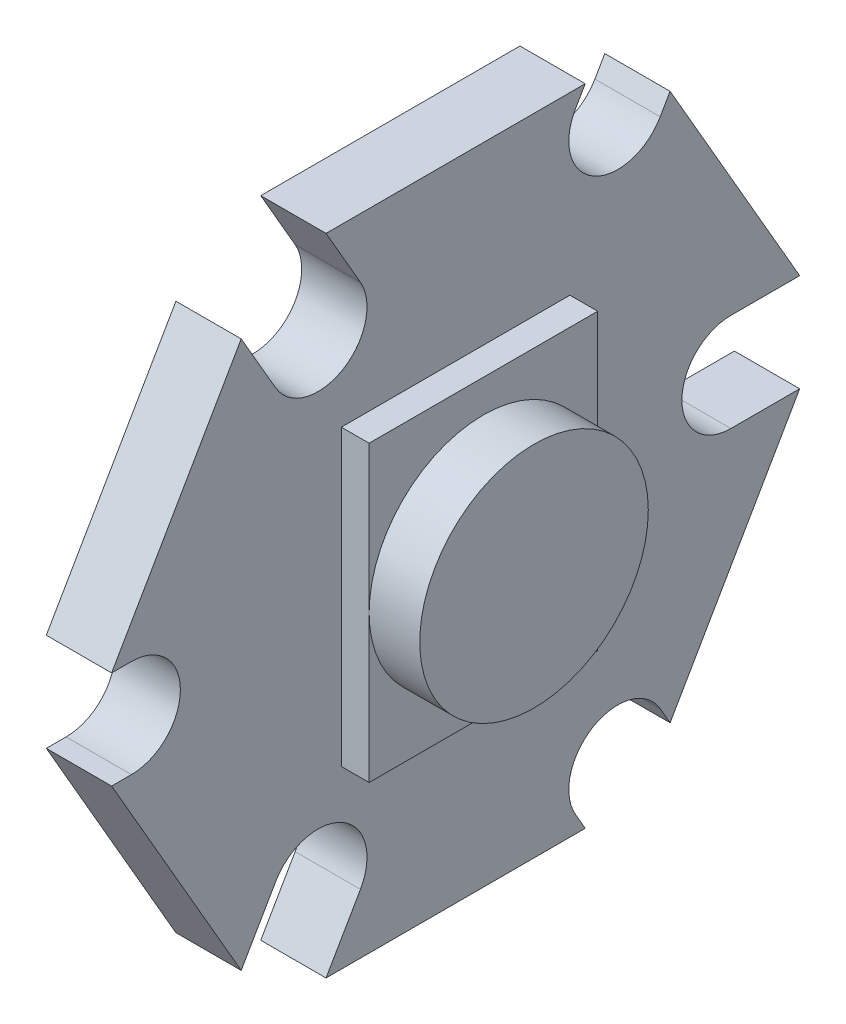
ISO-10303-21;
HEADER;
FILE_DESCRIPTION(('STEP AP214'),'2;1');
FILE_NAME('part.step','',(''),(''),'','','');
FILE_SCHEMA(('AUTOMOTIVE_DESIGN { 1 0 10303 214 1 1 1 1 }'));
ENDSEC;
DATA;
#1=APPLICATION_CONTEXT('core data for automotive mechanical design processes');
#2=APPLICATION_PROTOCOL_DEFINITION('international standard','automotive_design',2000,#1);
#3=PRODUCT_CONTEXT('',#1,'mechanical');
#4=PRODUCT('Part','Part','',(#3));
#5=PRODUCT_RELATED_PRODUCT_CATEGORY('part','',(#4));
#6=PRODUCT_DEFINITION_FORMATION('','',#4);
#7=PRODUCT_DEFINITION_CONTEXT('part definition',#1,'design');
#8=PRODUCT_DEFINITION('design','',#6,#7);
#9=PRODUCT_DEFINITION_SHAPE('','',#8);
#10=(LENGTH_UNIT() NAMED_UNIT(*) SI_UNIT(.MILLI.,.METRE.));
#11=(NAMED_UNIT(*) PLANE_ANGLE_UNIT() SI_UNIT($,.RADIAN.));
#12=(NAMED_UNIT(*) SI_UNIT($,.STERADIAN.) SOLID_ANGLE_UNIT());
#13=UNCERTAINTY_MEASURE_WITH_UNIT(LENGTH_MEASURE(1.E-05),#10,'distance_accuracy_value','');
#14=(GEOMETRIC_REPRESENTATION_CONTEXT(3) GLOBAL_UNCERTAINTY_ASSIGNED_CONTEXT((#13)) GLOBAL_UNIT_ASSIGNED_CONTEXT((#10,
#11,#12)) REPRESENTATION_CONTEXT('',''));
#15=CARTESIAN_POINT('',(0.,0.,0.));
#16=DIRECTION('',(0.,0.,1.));
#17=DIRECTION('',(1.,0.,0.));
#18=AXIS2_PLACEMENT_3D('',#15,#16,#17);
#19=CARTESIAN_POINT('',(1.85,0.,0.));
#20=DIRECTION('',(-1.,0.,0.));
#21=DIRECTION('',(0.,0.,1.));
#22=AXIS2_PLACEMENT_3D('',#19,#20,#21);
#23=PLANE('',#22);
#24=CARTESIAN_POINT('',(1.85,0.,0.));
#25=DIRECTION('',(1.,0.,0.));
#26=DIRECTION('',(0.,0.,-1.));
#27=AXIS2_PLACEMENT_3D('',#24,#25,#26);
#28=CIRCLE('',#27,3.5);
#29=CARTESIAN_POINT('',(1.85,0.,-3.5));
#30=VERTEX_POINT('',#29);
#31=CARTESIAN_POINT('',(1.85,0.,3.5));
#32=VERTEX_POINT('',#31);
#33=EDGE_CURVE('E61',#30,#32,#28,.T.);
#34=ORIENTED_EDGE('',*,*,#33,.F.);
#35=DIRECTION('',(0.,1.,0.));
#36=VECTOR('',#35,1.);
#37=CARTESIAN_POINT('',(1.85,-4.5,-3.5));
#38=LINE('',#37,#36);
#39=CARTESIAN_POINT('',(1.85,4.5,-3.5));
#40=VERTEX_POINT('',#39);
#41=EDGE_CURVE('E312',#30,#40,#38,.T.);
#42=ORIENTED_EDGE('',*,*,#41,.T.);
#43=DIRECTION('',(0.,0.,1.));
#44=VECTOR('',#43,1.);
#45=CARTESIAN_POINT('',(1.85,4.5,3.5));
#46=LINE('',#45,#44);
#47=CARTESIAN_POINT('',(1.85,4.5,3.5));
#48=VERTEX_POINT('',#47);
#49=EDGE_CURVE('E311',#40,#48,#46,.T.);
#50=ORIENTED_EDGE('',*,*,#49,.T.);
#51=DIRECTION('',(0.,-1.,0.));
#52=VECTOR('',#51,1.);
#53=CARTESIAN_POINT('',(1.85,-4.5,3.5));
#54=LINE('',#53,#52);
#55=EDGE_CURVE('E326',#48,#32,#54,.T.);
#56=ORIENTED_EDGE('',*,*,#55,.T.);
#57=EDGE_LOOP('',(#34,#42,#50,#56));
#58=FACE_BOUND('',#57,.T.);
#59=ADVANCED_FACE('F50',(#58),#23,.F.);
#60=EDGE_CURVE('E13',#32,#30,#28,.T.);
#61=ORIENTED_EDGE('',*,*,#60,.F.);
#62=CARTESIAN_POINT('',(1.85,-4.5,3.5));
#63=VERTEX_POINT('',#62);
#64=EDGE_CURVE('E788',#32,#63,#54,.T.);
#65=ORIENTED_EDGE('',*,*,#64,.T.);
#66=DIRECTION('',(0.,0.,-1.));
#67=VECTOR('',#66,1.);
#68=CARTESIAN_POINT('',(1.85,-4.5,3.5));
#69=LINE('',#68,#67);
#70=CARTESIAN_POINT('',(1.85,-4.5,-3.5));
#71=VERTEX_POINT('',#70);
#72=EDGE_CURVE('E306',#63,#71,#69,.T.);
#73=ORIENTED_EDGE('',*,*,#72,.T.);
#74=EDGE_CURVE('E303',#71,#30,#38,.T.);
#75=ORIENTED_EDGE('',*,*,#74,.T.);
#76=EDGE_LOOP('',(#61,#65,#73,#75));
#77=FACE_BOUND('',#76,.T.);
#78=ADVANCED_FACE('F305',(#77),#23,.F.);
#79=CARTESIAN_POINT('',(1.,0.,0.));
#80=DIRECTION('',(1.,0.,0.));
#81=DIRECTION('',(0.,0.,-1.));
#82=AXIS2_PLACEMENT_3D('',#79,#80,#81);
#83=PLANE('',#82);
#84=DIRECTION('',(0.,0.866025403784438,0.500000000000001));
#85=VECTOR('',#84,1.);
#86=CARTESIAN_POINT('',(1.,-7.84999999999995,-6.26425042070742));
#87=LINE('',#86,#85);
#88=CARTESIAN_POINT('',(1.,-8.375,-6.567359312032));
#89=VERTEX_POINT('',#88);
#90=CARTESIAN_POINT('',(1.,-7.84999999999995,-6.26425042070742));
#91=VERTEX_POINT('',#90);
#92=EDGE_CURVE('E734',#89,#91,#87,.T.);
#93=ORIENTED_EDGE('',*,*,#92,.F.);
#94=DIRECTION('',(0.,0.866025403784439,-0.499999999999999));
#95=VECTOR('',#94,1.);
#96=CARTESIAN_POINT('',(1.,-9.875,-5.70133390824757));
#97=LINE('',#96,#95);
#98=CARTESIAN_POINT('',(1.,-1.5,-10.5366424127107));
#99=VERTEX_POINT('',#98);
#100=EDGE_CURVE('E493',#89,#99,#97,.T.);
#101=ORIENTED_EDGE('',*,*,#100,.T.);
#102=DIRECTION('',(0.,0.,-1.));
#103=VECTOR('',#102,1.);
#104=CARTESIAN_POINT('',(1.,-1.5,-8.4293139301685));
#105=LINE('',#104,#103);
#106=CARTESIAN_POINT('',(1.,-1.5,-8.4293139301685));
#107=VERTEX_POINT('',#106);
#108=EDGE_CURVE('E704',#107,#99,#105,.T.);
#109=ORIENTED_EDGE('',*,*,#108,.F.);
#110=CARTESIAN_POINT('',(1.,1.85615411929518E-13,-8.42931393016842));
#111=DIRECTION('',(1.,0.,0.));
#112=DIRECTION('',(0.,0.,-1.));
#113=AXIS2_PLACEMENT_3D('',#110,#111,#112);
#114=CIRCLE('',#113,1.5);
#115=CARTESIAN_POINT('',(1.,1.5,-8.4293139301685));
#116=VERTEX_POINT('',#115);
#117=EDGE_CURVE('E691',#116,#107,#114,.T.);
#118=ORIENTED_EDGE('',*,*,#117,.F.);
#119=DIRECTION('',(0.,0.,1.));
#120=VECTOR('',#119,1.);
#121=CARTESIAN_POINT('',(1.,1.5,-8.4293139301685));
#122=LINE('',#121,#120);
#123=CARTESIAN_POINT('',(1.,1.5,-10.5366424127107));
#124=VERTEX_POINT('',#123);
#125=EDGE_CURVE('E697',#124,#116,#122,.T.);
#126=ORIENTED_EDGE('',*,*,#125,.F.);
#127=DIRECTION('',(0.,0.866025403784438,0.500000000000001));
#128=VECTOR('',#127,1.);
#129=CARTESIAN_POINT('',(1.,0.,-11.4026678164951));
#130=LINE('',#129,#128);
#131=CARTESIAN_POINT('',(1.,8.37500000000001,-6.56735931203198));
#132=VERTEX_POINT('',#131);
#133=EDGE_CURVE('E474',#124,#132,#130,.T.);
#134=ORIENTED_EDGE('',*,*,#133,.T.);
#135=DIRECTION('',(0.,0.86602540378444,-0.499999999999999));
#136=VECTOR('',#135,1.);
#137=CARTESIAN_POINT('',(1.,7.84999999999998,-6.26425042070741));
#138=LINE('',#137,#136);
#139=CARTESIAN_POINT('',(1.,7.84999999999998,-6.26425042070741));
#140=VERTEX_POINT('',#139);
#141=EDGE_CURVE('E562',#140,#132,#138,.T.);
#142=ORIENTED_EDGE('',*,*,#141,.F.);
#143=CARTESIAN_POINT('',(1.,8.59999999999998,-4.96521231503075));
#144=DIRECTION('',(1.,0.,0.));
#145=DIRECTION('',(0.,0.,-1.));
#146=AXIS2_PLACEMENT_3D('',#143,#144,#145);
#147=CIRCLE('',#146,1.5);
#148=CARTESIAN_POINT('',(1.,9.34999999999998,-3.66617420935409));
#149=VERTEX_POINT('',#148);
#150=EDGE_CURVE('E555',#149,#140,#147,.T.);
#151=ORIENTED_EDGE('',*,*,#150,.F.);
#152=DIRECTION('',(0.,-0.866025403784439,0.499999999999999));
#153=VECTOR('',#152,1.);
#154=CARTESIAN_POINT('',(1.,9.34999999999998,-3.66617420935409));
#155=LINE('',#154,#153);
#156=CARTESIAN_POINT('',(1.,9.87500000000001,-3.96928310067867));
#157=VERTEX_POINT('',#156);
#158=EDGE_CURVE('E572',#157,#149,#155,.T.);
#159=ORIENTED_EDGE('',*,*,#158,.F.);
#160=DIRECTION('',(0.,0.,1.));
#161=VECTOR('',#160,1.);
#162=CARTESIAN_POINT('',(1.,9.87500000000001,-5.70133390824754));
#163=LINE('',#162,#161);
#164=CARTESIAN_POINT('',(1.,9.87500000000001,3.96928310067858));
#165=VERTEX_POINT('',#164);
#166=EDGE_CURVE('E464',#157,#165,#163,.T.);
#167=ORIENTED_EDGE('',*,*,#166,.T.);
#168=DIRECTION('',(0.,0.866025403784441,0.499999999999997));
#169=VECTOR('',#168,1.);
#170=CARTESIAN_POINT('',(1.,8.05000000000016,2.91561885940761));
#171=LINE('',#170,#169);
#172=CARTESIAN_POINT('',(1.,8.05000000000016,2.91561885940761));
#173=VERTEX_POINT('',#172);
#174=EDGE_CURVE('E674',#173,#165,#171,.T.);
#175=ORIENTED_EDGE('',*,*,#174,.F.);
#176=CARTESIAN_POINT('',(1.,7.30000000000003,4.21465696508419));
#177=DIRECTION('',(1.,0.,0.));
#178=DIRECTION('',(0.,0.,-1.));
#179=AXIS2_PLACEMENT_3D('',#176,#177,#178);
#180=CIRCLE('',#179,1.5);
#181=CARTESIAN_POINT('',(1.,6.55000000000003,5.51369507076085));
#182=VERTEX_POINT('',#181);
#183=EDGE_CURVE('E660',#182,#173,#180,.T.);
#184=ORIENTED_EDGE('',*,*,#183,.F.);
#185=DIRECTION('',(0.,-0.866025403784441,-0.499999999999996));
#186=VECTOR('',#185,1.);
#187=CARTESIAN_POINT('',(1.,6.55000000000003,5.51369507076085));
#188=LINE('',#187,#186);
#189=CARTESIAN_POINT('',(1.,8.37500000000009,6.56735931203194));
#190=VERTEX_POINT('',#189);
#191=EDGE_CURVE('E666',#190,#182,#188,.T.);
#192=ORIENTED_EDGE('',*,*,#191,.F.);
#193=DIRECTION('',(0.,-0.866025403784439,0.499999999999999));
#194=VECTOR('',#193,1.);
#195=CARTESIAN_POINT('',(1.,9.875,5.70133390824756));
#196=LINE('',#195,#194);
#197=CARTESIAN_POINT('',(1.,1.5,10.5366424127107));
#198=VERTEX_POINT('',#197);
#199=EDGE_CURVE('E473',#190,#198,#196,.T.);
#200=ORIENTED_EDGE('',*,*,#199,.T.);
#201=DIRECTION('',(0.,0.,1.));
#202=VECTOR('',#201,1.);
#203=CARTESIAN_POINT('',(1.,1.5,9.93042463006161));
#204=LINE('',#203,#202);
#205=CARTESIAN_POINT('',(1.,1.5,9.93042463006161));
#206=VERTEX_POINT('',#205);
#207=EDGE_CURVE('E607',#206,#198,#204,.T.);
#208=ORIENTED_EDGE('',*,*,#207,.F.);
#209=CARTESIAN_POINT('',(1.,0.,9.93042463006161));
#210=DIRECTION('',(1.,0.,0.));
#211=DIRECTION('',(0.,0.,-1.));
#212=AXIS2_PLACEMENT_3D('',#209,#210,#211);
#213=CIRCLE('',#212,1.5);
#214=CARTESIAN_POINT('',(1.,-1.5,9.93042463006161));
#215=VERTEX_POINT('',#214);
#216=EDGE_CURVE('E593',#215,#206,#213,.T.);
#217=ORIENTED_EDGE('',*,*,#216,.F.);
#218=DIRECTION('',(0.,0.,-1.));
#219=VECTOR('',#218,1.);
#220=CARTESIAN_POINT('',(1.,-1.5,9.93042463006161));
#221=LINE('',#220,#219);
#222=CARTESIAN_POINT('',(1.,-1.5,10.5366424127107));
#223=VERTEX_POINT('',#222);
#224=EDGE_CURVE('E599',#223,#215,#221,.T.);
#225=ORIENTED_EDGE('',*,*,#224,.F.);
#226=DIRECTION('',(0.,-0.866025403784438,-0.500000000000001));
#227=VECTOR('',#226,1.);
#228=CARTESIAN_POINT('',(1.,0.,11.4026678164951));
#229=LINE('',#228,#227);
#230=CARTESIAN_POINT('',(1.,-8.37499999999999,6.567359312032));
#231=VERTEX_POINT('',#230);
#232=EDGE_CURVE('E480',#223,#231,#229,.T.);
#233=ORIENTED_EDGE('',*,*,#232,.T.);
#234=DIRECTION('',(0.,-0.866025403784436,0.500000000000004));
#235=VECTOR('',#234,1.);
#236=CARTESIAN_POINT('',(1.,-6.54999999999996,5.5136950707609));
#237=LINE('',#236,#235);
#238=CARTESIAN_POINT('',(1.,-6.54999999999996,5.5136950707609));
#239=VERTEX_POINT('',#238);
#240=EDGE_CURVE('E640',#239,#231,#237,.T.);
#241=ORIENTED_EDGE('',*,*,#240,.F.);
#242=CARTESIAN_POINT('',(1.,-7.29999999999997,4.21465696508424));
#243=DIRECTION('',(1.,0.,0.));
#244=DIRECTION('',(0.,0.,-1.));
#245=AXIS2_PLACEMENT_3D('',#242,#243,#244);
#246=CIRCLE('',#245,1.5);
#247=CARTESIAN_POINT('',(1.,-8.04999999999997,2.91561885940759));
#248=VERTEX_POINT('',#247);
#249=EDGE_CURVE('E626',#248,#239,#246,.T.);
#250=ORIENTED_EDGE('',*,*,#249,.F.);
#251=DIRECTION('',(0.,0.866025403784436,-0.500000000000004));
#252=VECTOR('',#251,1.);
#253=CARTESIAN_POINT('',(1.,-8.04999999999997,2.91561885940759));
#254=LINE('',#253,#252);
#255=CARTESIAN_POINT('',(1.,-9.87500000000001,3.96928310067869));
#256=VERTEX_POINT('',#255);
#257=EDGE_CURVE('E632',#256,#248,#254,.T.);
#258=ORIENTED_EDGE('',*,*,#257,.F.);
#259=DIRECTION('',(0.,0.,-1.));
#260=VECTOR('',#259,1.);
#261=CARTESIAN_POINT('',(1.,-9.87500000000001,5.70133390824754));
#262=LINE('',#261,#260);
#263=CARTESIAN_POINT('',(1.,-9.87500000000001,-3.9692831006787));
#264=VERTEX_POINT('',#263);
#265=EDGE_CURVE('E489',#256,#264,#262,.T.);
#266=ORIENTED_EDGE('',*,*,#265,.T.);
#267=DIRECTION('',(0.,-0.866025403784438,-0.500000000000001));
#268=VECTOR('',#267,1.);
#269=CARTESIAN_POINT('',(1.,-9.34999999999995,-3.66617420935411));
#270=LINE('',#269,#268);
#271=CARTESIAN_POINT('',(1.,-9.34999999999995,-3.66617420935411));
#272=VERTEX_POINT('',#271);
#273=EDGE_CURVE('E739',#272,#264,#270,.T.);
#274=ORIENTED_EDGE('',*,*,#273,.F.);
#275=CARTESIAN_POINT('',(1.,-8.59999999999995,-4.96521231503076));
#276=DIRECTION('',(1.,0.,0.));
#277=DIRECTION('',(0.,0.,-1.));
#278=AXIS2_PLACEMENT_3D('',#275,#276,#277);
#279=CIRCLE('',#278,1.5);
#280=EDGE_CURVE('E737',#91,#272,#279,.T.);
#281=ORIENTED_EDGE('',*,*,#280,.F.);
#282=EDGE_LOOP('',(#93,#101,#109,#118,#126,#134,#142,#151,#159,#167,#175,#184,#192,#200,#208,
#217,#225,#233,#241,#250,#258,#266,#274,#281));
#283=FACE_BOUND('',#282,.T.);
#284=DIRECTION('',(0.,0.,1.));
#285=VECTOR('',#284,1.);
#286=CARTESIAN_POINT('',(1.,4.5,3.5));
#287=LINE('',#286,#285);
#288=CARTESIAN_POINT('',(1.,4.5,-3.5));
#289=VERTEX_POINT('',#288);
#290=CARTESIAN_POINT('',(1.,4.5,3.5));
#291=VERTEX_POINT('',#290);
#292=EDGE_CURVE('E778',#289,#291,#287,.T.);
#293=ORIENTED_EDGE('',*,*,#292,.F.);
#294=DIRECTION('',(0.,1.,0.));
#295=VECTOR('',#294,1.);
#296=CARTESIAN_POINT('',(1.,-4.5,-3.5));
#297=LINE('',#296,#295);
#298=CARTESIAN_POINT('',(1.,-4.5,-3.5));
#299=VERTEX_POINT('',#298);
#300=EDGE_CURVE('E781',#299,#289,#297,.T.);
#301=ORIENTED_EDGE('',*,*,#300,.F.);
#302=DIRECTION('',(0.,0.,-1.));
#303=VECTOR('',#302,1.);
#304=CARTESIAN_POINT('',(1.,-4.5,3.5));
#305=LINE('',#304,#303);
#306=CARTESIAN_POINT('',(1.,-4.5,3.5));
#307=VERTEX_POINT('',#306);
#308=EDGE_CURVE('E322',#307,#299,#305,.T.);
#309=ORIENTED_EDGE('',*,*,#308,.F.);
#310=DIRECTION('',(0.,-1.,0.));
#311=VECTOR('',#310,1.);
#312=CARTESIAN_POINT('',(1.,-4.5,3.5));
#313=LINE('',#312,#311);
#314=EDGE_CURVE('E775',#291,#307,#313,.T.);
#315=ORIENTED_EDGE('',*,*,#314,.F.);
#316=EDGE_LOOP('',(#293,#301,#309,#315));
#317=FACE_BOUND('',#316,.T.);
#318=ADVANCED_FACE('F349',(#283,#317),#83,.T.);
#319=CARTESIAN_POINT('',(1.,0.,-11.4026678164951));
#320=DIRECTION('',(0.,-0.500000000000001,0.866025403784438));
#321=DIRECTION('',(0.,-0.866025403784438,-0.500000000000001));
#322=AXIS2_PLACEMENT_3D('',#319,#320,#321);
#323=PLANE('',#322);
#324=DIRECTION('',(0.,0.866025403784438,0.500000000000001));
#325=VECTOR('',#324,1.);
#326=CARTESIAN_POINT('',(-1.,0.,-11.4026678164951));
#327=LINE('',#326,#325);
#328=CARTESIAN_POINT('',(-1.,1.5,-10.5366424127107));
#329=VERTEX_POINT('',#328);
#330=CARTESIAN_POINT('',(-1.,8.37500000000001,-6.56735931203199));
#331=VERTEX_POINT('',#330);
#332=EDGE_CURVE('E497',#329,#331,#327,.T.);
#333=ORIENTED_EDGE('',*,*,#332,.T.);
#334=DIRECTION('',(1.,0.,0.));
#335=VECTOR('',#334,1.);
#336=CARTESIAN_POINT('',(1.,8.37500000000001,-6.56735931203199));
#337=LINE('',#336,#335);
#338=EDGE_CURVE('E585',#331,#132,#337,.T.);
#339=ORIENTED_EDGE('',*,*,#338,.T.);
#340=ORIENTED_EDGE('',*,*,#133,.F.);
#341=DIRECTION('',(-1.,0.,0.));
#342=VECTOR('',#341,1.);
#343=CARTESIAN_POINT('',(1.,1.5,-10.5366424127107));
#344=LINE('',#343,#342);
#345=EDGE_CURVE('E502',#124,#329,#344,.T.);
#346=ORIENTED_EDGE('',*,*,#345,.T.);
#347=EDGE_LOOP('',(#333,#339,#340,#346));
#348=FACE_BOUND('',#347,.T.);
#349=ADVANCED_FACE('F52',(#348),#323,.F.);
#350=CARTESIAN_POINT('',(1.,9.87500000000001,-5.70133390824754));
#351=DIRECTION('',(0.,-1.,0.));
#352=DIRECTION('',(0.,0.,-1.));
#353=AXIS2_PLACEMENT_3D('',#350,#351,#352);
#354=PLANE('',#353);
#355=ORIENTED_EDGE('',*,*,#166,.F.);
#356=DIRECTION('',(-1.,0.,0.));
#357=VECTOR('',#356,1.);
#358=CARTESIAN_POINT('',(1.,9.87500000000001,-3.96928310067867));
#359=LINE('',#358,#357);
#360=CARTESIAN_POINT('',(-1.,9.87500000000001,-3.96928310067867));
#361=VERTEX_POINT('',#360);
#362=EDGE_CURVE('E465',#157,#361,#359,.T.);
#363=ORIENTED_EDGE('',*,*,#362,.T.);
#364=DIRECTION('',(0.,0.,1.));
#365=VECTOR('',#364,1.);
#366=CARTESIAN_POINT('',(-1.,9.87500000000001,-5.70133390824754));
#367=LINE('',#366,#365);
#368=CARTESIAN_POINT('',(-1.,9.87500000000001,3.96928310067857));
#369=VERTEX_POINT('',#368);
#370=EDGE_CURVE('E501',#361,#369,#367,.T.);
#371=ORIENTED_EDGE('',*,*,#370,.T.);
#372=DIRECTION('',(1.,0.,0.));
#373=VECTOR('',#372,1.);
#374=CARTESIAN_POINT('',(1.,9.875,3.96928310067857));
#375=LINE('',#374,#373);
#376=EDGE_CURVE('E468',#369,#165,#375,.T.);
#377=ORIENTED_EDGE('',*,*,#376,.T.);
#378=EDGE_LOOP('',(#355,#363,#371,#377));
#379=FACE_BOUND('',#378,.T.);
#380=ADVANCED_FACE('F453',(#379),#354,.F.);
#381=CARTESIAN_POINT('',(1.,9.875,5.70133390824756));
#382=DIRECTION('',(0.,-0.499999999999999,-0.866025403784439));
#383=DIRECTION('',(0.,0.866025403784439,-0.5));
#384=AXIS2_PLACEMENT_3D('',#381,#382,#383);
#385=PLANE('',#384);
#386=DIRECTION('',(0.,-0.866025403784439,0.499999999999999));
#387=VECTOR('',#386,1.);
#388=CARTESIAN_POINT('',(-1.,9.875,5.70133390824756));
#389=LINE('',#388,#387);
#390=CARTESIAN_POINT('',(-1.,8.37500000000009,6.56735931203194));
#391=VERTEX_POINT('',#390);
#392=CARTESIAN_POINT('',(-1.,1.5,10.5366424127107));
#393=VERTEX_POINT('',#392);
#394=EDGE_CURVE('E505',#391,#393,#389,.T.);
#395=ORIENTED_EDGE('',*,*,#394,.T.);
#396=DIRECTION('',(1.,0.,0.));
#397=VECTOR('',#396,1.);
#398=CARTESIAN_POINT('',(1.,1.5,10.5366424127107));
#399=LINE('',#398,#397);
#400=EDGE_CURVE('E616',#393,#198,#399,.T.);
#401=ORIENTED_EDGE('',*,*,#400,.T.);
#402=ORIENTED_EDGE('',*,*,#199,.F.);
#403=DIRECTION('',(-1.,0.,0.));
#404=VECTOR('',#403,1.);
#405=CARTESIAN_POINT('',(1.,8.3750000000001,6.56735931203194));
#406=LINE('',#405,#404);
#407=EDGE_CURVE('E687',#190,#391,#406,.T.);
#408=ORIENTED_EDGE('',*,*,#407,.T.);
#409=EDGE_LOOP('',(#395,#401,#402,#408));
#410=FACE_BOUND('',#409,.T.);
#411=ADVANCED_FACE('F450',(#410),#385,.F.);
#412=CARTESIAN_POINT('',(1.,0.,11.4026678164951));
#413=DIRECTION('',(0.,0.500000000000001,-0.866025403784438));
#414=DIRECTION('',(0.,0.866025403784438,0.500000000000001));
#415=AXIS2_PLACEMENT_3D('',#412,#413,#414);
#416=PLANE('',#415);
#417=ORIENTED_EDGE('',*,*,#232,.F.);
#418=DIRECTION('',(-1.,0.,0.));
#419=VECTOR('',#418,1.);
#420=CARTESIAN_POINT('',(1.,-1.5,10.5366424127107));
#421=LINE('',#420,#419);
#422=CARTESIAN_POINT('',(-1.,-1.5,10.5366424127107));
#423=VERTEX_POINT('',#422);
#424=EDGE_CURVE('E622',#223,#423,#421,.T.);
#425=ORIENTED_EDGE('',*,*,#424,.T.);
#426=DIRECTION('',(0.,-0.866025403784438,-0.500000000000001));
#427=VECTOR('',#426,1.);
#428=CARTESIAN_POINT('',(-1.,0.,11.4026678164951));
#429=LINE('',#428,#427);
#430=CARTESIAN_POINT('',(-1.,-8.37499999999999,6.567359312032));
#431=VERTEX_POINT('',#430);
#432=EDGE_CURVE('E509',#423,#431,#429,.T.);
#433=ORIENTED_EDGE('',*,*,#432,.T.);
#434=DIRECTION('',(1.,0.,0.));
#435=VECTOR('',#434,1.);
#436=CARTESIAN_POINT('',(1.,-8.37499999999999,6.56735931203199));
#437=LINE('',#436,#435);
#438=EDGE_CURVE('E650',#431,#231,#437,.T.);
#439=ORIENTED_EDGE('',*,*,#438,.T.);
#440=EDGE_LOOP('',(#417,#425,#433,#439));
#441=FACE_BOUND('',#440,.T.);
#442=ADVANCED_FACE('F446',(#441),#416,.F.);
#443=CARTESIAN_POINT('',(1.,-9.87500000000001,5.70133390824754));
#444=DIRECTION('',(0.,1.,0.));
#445=DIRECTION('',(0.,0.,1.));
#446=AXIS2_PLACEMENT_3D('',#443,#444,#445);
#447=PLANE('',#446);
#448=DIRECTION('',(0.,0.,-1.));
#449=VECTOR('',#448,1.);
#450=CARTESIAN_POINT('',(-1.,-9.87500000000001,5.70133390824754));
#451=LINE('',#450,#449);
#452=CARTESIAN_POINT('',(-1.,-9.87500000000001,3.96928310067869));
#453=VERTEX_POINT('',#452);
#454=CARTESIAN_POINT('',(-1.,-9.87500000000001,-3.96928310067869));
#455=VERTEX_POINT('',#454);
#456=EDGE_CURVE('E512',#453,#455,#451,.T.);
#457=ORIENTED_EDGE('',*,*,#456,.T.);
#458=DIRECTION('',(1.,0.,0.));
#459=VECTOR('',#458,1.);
#460=CARTESIAN_POINT('',(1.,-9.875,-3.96928310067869));
#461=LINE('',#460,#459);
#462=EDGE_CURVE('E556',#455,#264,#461,.T.);
#463=ORIENTED_EDGE('',*,*,#462,.T.);
#464=ORIENTED_EDGE('',*,*,#265,.F.);
#465=DIRECTION('',(-1.,0.,0.));
#466=VECTOR('',#465,1.);
#467=CARTESIAN_POINT('',(1.,-9.87500000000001,3.96928310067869));
#468=LINE('',#467,#466);
#469=EDGE_CURVE('E656',#256,#453,#468,.T.);
#470=ORIENTED_EDGE('',*,*,#469,.T.);
#471=EDGE_LOOP('',(#457,#463,#464,#470));
#472=FACE_BOUND('',#471,.T.);
#473=ADVANCED_FACE('F442',(#472),#447,.F.);
#474=CARTESIAN_POINT('',(1.,-9.875,-5.70133390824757));
#475=DIRECTION('',(0.,0.499999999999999,0.866025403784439));
#476=DIRECTION('',(0.,-0.866025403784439,0.499999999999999));
#477=AXIS2_PLACEMENT_3D('',#474,#475,#476);
#478=PLANE('',#477);
#479=ORIENTED_EDGE('',*,*,#100,.F.);
#480=DIRECTION('',(-1.,0.,0.));
#481=VECTOR('',#480,1.);
#482=CARTESIAN_POINT('',(1.,-8.375,-6.567359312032));
#483=LINE('',#482,#481);
#484=CARTESIAN_POINT('',(-1.,-8.375,-6.567359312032));
#485=VERTEX_POINT('',#484);
#486=EDGE_CURVE('E547',#89,#485,#483,.T.);
#487=ORIENTED_EDGE('',*,*,#486,.T.);
#488=DIRECTION('',(0.,0.866025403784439,-0.499999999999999));
#489=VECTOR('',#488,1.);
#490=CARTESIAN_POINT('',(-1.,-9.875,-5.70133390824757));
#491=LINE('',#490,#489);
#492=CARTESIAN_POINT('',(-1.,-1.5,-10.5366424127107));
#493=VERTEX_POINT('',#492);
#494=EDGE_CURVE('E483',#485,#493,#491,.T.);
#495=ORIENTED_EDGE('',*,*,#494,.T.);
#496=DIRECTION('',(1.,0.,0.));
#497=VECTOR('',#496,1.);
#498=CARTESIAN_POINT('',(1.,-1.5,-10.5366424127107));
#499=LINE('',#498,#497);
#500=EDGE_CURVE('E714',#493,#99,#499,.T.);
#501=ORIENTED_EDGE('',*,*,#500,.T.);
#502=EDGE_LOOP('',(#479,#487,#495,#501));
#503=FACE_BOUND('',#502,.T.);
#504=ADVANCED_FACE('F438',(#503),#478,.F.);
#505=CARTESIAN_POINT('',(-1.,0.,0.));
#506=DIRECTION('',(1.,0.,0.));
#507=DIRECTION('',(0.,0.,-1.));
#508=AXIS2_PLACEMENT_3D('',#505,#506,#507);
#509=PLANE('',#508);
#510=ORIENTED_EDGE('',*,*,#494,.F.);
#511=DIRECTION('',(0.,0.866025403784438,0.500000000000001));
#512=VECTOR('',#511,1.);
#513=CARTESIAN_POINT('',(-1.,0.750000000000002,-1.29903810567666));
#514=LINE('',#513,#512);
#515=CARTESIAN_POINT('',(-1.,-7.84999999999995,-6.26425042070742));
#516=VERTEX_POINT('',#515);
#517=EDGE_CURVE('E54',#485,#516,#514,.T.);
#518=ORIENTED_EDGE('',*,*,#517,.T.);
#519=CARTESIAN_POINT('',(-1.,-8.59999999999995,-4.96521231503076));
#520=DIRECTION('',(1.,0.,0.));
#521=DIRECTION('',(0.,0.,-1.));
#522=AXIS2_PLACEMENT_3D('',#519,#520,#521);
#523=CIRCLE('',#522,1.5);
#524=CARTESIAN_POINT('',(-1.,-9.34999999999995,-3.66617420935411));
#525=VERTEX_POINT('',#524);
#526=EDGE_CURVE('E544',#516,#525,#523,.T.);
#527=ORIENTED_EDGE('',*,*,#526,.T.);
#528=DIRECTION('',(0.,-0.866025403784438,-0.500000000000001));
#529=VECTOR('',#528,1.);
#530=CARTESIAN_POINT('',(-1.,-9.34999999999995,-3.66617420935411));
#531=LINE('',#530,#529);
#532=EDGE_CURVE('E744',#525,#455,#531,.T.);
#533=ORIENTED_EDGE('',*,*,#532,.T.);
#534=ORIENTED_EDGE('',*,*,#456,.F.);
#535=DIRECTION('',(0.,0.866025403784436,-0.500000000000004));
#536=VECTOR('',#535,1.);
#537=CARTESIAN_POINT('',(-1.,-0.750000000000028,-1.29903810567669));
#538=LINE('',#537,#536);
#539=CARTESIAN_POINT('',(-1.,-8.04999999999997,2.91561885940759));
#540=VERTEX_POINT('',#539);
#541=EDGE_CURVE('E525',#453,#540,#538,.T.);
#542=ORIENTED_EDGE('',*,*,#541,.T.);
#543=CARTESIAN_POINT('',(-1.,-7.29999999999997,4.21465696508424));
#544=DIRECTION('',(1.,0.,0.));
#545=DIRECTION('',(0.,0.,-1.));
#546=AXIS2_PLACEMENT_3D('',#543,#544,#545);
#547=CIRCLE('',#546,1.5);
#548=CARTESIAN_POINT('',(-1.,-6.54999999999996,5.5136950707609));
#549=VERTEX_POINT('',#548);
#550=EDGE_CURVE('E627',#540,#549,#547,.T.);
#551=ORIENTED_EDGE('',*,*,#550,.T.);
#552=DIRECTION('',(0.,-0.866025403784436,0.500000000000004));
#553=VECTOR('',#552,1.);
#554=CARTESIAN_POINT('',(-1.,-6.54999999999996,5.5136950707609));
#555=LINE('',#554,#553);
#556=EDGE_CURVE('E631',#549,#431,#555,.T.);
#557=ORIENTED_EDGE('',*,*,#556,.T.);
#558=ORIENTED_EDGE('',*,*,#432,.F.);
#559=DIRECTION('',(0.,0.,-1.));
#560=VECTOR('',#559,1.);
#561=CARTESIAN_POINT('',(-1.,-1.5,0.));
#562=LINE('',#561,#560);
#563=CARTESIAN_POINT('',(-1.,-1.5,9.93042463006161));
#564=VERTEX_POINT('',#563);
#565=EDGE_CURVE('E529',#423,#564,#562,.T.);
#566=ORIENTED_EDGE('',*,*,#565,.T.);
#567=CARTESIAN_POINT('',(-1.,0.,9.93042463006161));
#568=DIRECTION('',(1.,0.,0.));
#569=DIRECTION('',(0.,0.,-1.));
#570=AXIS2_PLACEMENT_3D('',#567,#568,#569);
#571=CIRCLE('',#570,1.5);
#572=CARTESIAN_POINT('',(-1.,1.5,9.93042463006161));
#573=VERTEX_POINT('',#572);
#574=EDGE_CURVE('E594',#564,#573,#571,.T.);
#575=ORIENTED_EDGE('',*,*,#574,.T.);
#576=DIRECTION('',(0.,0.,1.));
#577=VECTOR('',#576,1.);
#578=CARTESIAN_POINT('',(-1.,1.5,9.93042463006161));
#579=LINE('',#578,#577);
#580=EDGE_CURVE('E598',#573,#393,#579,.T.);
#581=ORIENTED_EDGE('',*,*,#580,.T.);
#582=ORIENTED_EDGE('',*,*,#394,.F.);
#583=DIRECTION('',(0.,-0.866025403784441,-0.499999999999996));
#584=VECTOR('',#583,1.);
#585=CARTESIAN_POINT('',(-1.,-0.749999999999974,1.29903810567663));
#586=LINE('',#585,#584);
#587=CARTESIAN_POINT('',(-1.,6.55000000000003,5.51369507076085));
#588=VERTEX_POINT('',#587);
#589=EDGE_CURVE('E521',#391,#588,#586,.T.);
#590=ORIENTED_EDGE('',*,*,#589,.T.);
#591=CARTESIAN_POINT('',(-1.,7.30000000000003,4.21465696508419));
#592=DIRECTION('',(1.,0.,0.));
#593=DIRECTION('',(0.,0.,-1.));
#594=AXIS2_PLACEMENT_3D('',#591,#592,#593);
#595=CIRCLE('',#594,1.5);
#596=CARTESIAN_POINT('',(-1.,8.05000000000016,2.91561885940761));
#597=VERTEX_POINT('',#596);
#598=EDGE_CURVE('E661',#588,#597,#595,.T.);
#599=ORIENTED_EDGE('',*,*,#598,.T.);
#600=DIRECTION('',(0.,0.866025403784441,0.499999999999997));
#601=VECTOR('',#600,1.);
#602=CARTESIAN_POINT('',(-1.,8.05000000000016,2.91561885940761));
#603=LINE('',#602,#601);
#604=EDGE_CURVE('E665',#597,#369,#603,.T.);
#605=ORIENTED_EDGE('',*,*,#604,.T.);
#606=ORIENTED_EDGE('',*,*,#370,.F.);
#607=DIRECTION('',(0.,-0.866025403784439,0.499999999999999));
#608=VECTOR('',#607,1.);
#609=CARTESIAN_POINT('',(-1.,0.749999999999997,1.29903810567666));
#610=LINE('',#609,#608);
#611=CARTESIAN_POINT('',(-1.,9.34999999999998,-3.66617420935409));
#612=VERTEX_POINT('',#611);
#613=EDGE_CURVE('E532',#361,#612,#610,.T.);
#614=ORIENTED_EDGE('',*,*,#613,.T.);
#615=CARTESIAN_POINT('',(-1.,8.59999999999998,-4.96521231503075));
#616=DIRECTION('',(1.,0.,0.));
#617=DIRECTION('',(0.,0.,-1.));
#618=AXIS2_PLACEMENT_3D('',#615,#616,#617);
#619=CIRCLE('',#618,1.5);
#620=CARTESIAN_POINT('',(-1.,7.84999999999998,-6.26425042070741));
#621=VERTEX_POINT('',#620);
#622=EDGE_CURVE('E568',#612,#621,#619,.T.);
#623=ORIENTED_EDGE('',*,*,#622,.T.);
#624=DIRECTION('',(0.,0.86602540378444,-0.499999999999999));
#625=VECTOR('',#624,1.);
#626=CARTESIAN_POINT('',(-1.,7.84999999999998,-6.26425042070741));
#627=LINE('',#626,#625);
#628=EDGE_CURVE('E571',#621,#331,#627,.T.);
#629=ORIENTED_EDGE('',*,*,#628,.T.);
#630=ORIENTED_EDGE('',*,*,#332,.F.);
#631=DIRECTION('',(0.,0.,1.));
#632=VECTOR('',#631,1.);
#633=CARTESIAN_POINT('',(-1.,1.5,0.));
#634=LINE('',#633,#632);
#635=CARTESIAN_POINT('',(-1.,1.5,-8.4293139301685));
#636=VERTEX_POINT('',#635);
#637=EDGE_CURVE('E496',#329,#636,#634,.T.);
#638=ORIENTED_EDGE('',*,*,#637,.T.);
#639=CARTESIAN_POINT('',(-1.,1.85615411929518E-13,-8.42931393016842));
#640=DIRECTION('',(1.,0.,0.));
#641=DIRECTION('',(0.,0.,-1.));
#642=AXIS2_PLACEMENT_3D('',#639,#640,#641);
#643=CIRCLE('',#642,1.5);
#644=CARTESIAN_POINT('',(-1.,-1.5,-8.4293139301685));
#645=VERTEX_POINT('',#644);
#646=EDGE_CURVE('E692',#636,#645,#643,.T.);
#647=ORIENTED_EDGE('',*,*,#646,.T.);
#648=DIRECTION('',(0.,0.,-1.));
#649=VECTOR('',#648,1.);
#650=CARTESIAN_POINT('',(-1.,-1.5,-8.4293139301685));
#651=LINE('',#650,#649);
#652=EDGE_CURVE('E696',#645,#493,#651,.T.);
#653=ORIENTED_EDGE('',*,*,#652,.T.);
#654=EDGE_LOOP('',(#510,#518,#527,#533,#534,#542,#551,#557,#558,#566,#575,#581,#582,#590,#599,
#605,#606,#614,#623,#629,#630,#638,#647,#653));
#655=FACE_BOUND('',#654,.T.);
#656=ADVANCED_FACE('F425',(#655),#509,.F.);
#657=CARTESIAN_POINT('',(-1.,1.5,-8.4293139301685));
#658=DIRECTION('',(0.,1.,0.));
#659=DIRECTION('',(0.,0.,1.));
#660=AXIS2_PLACEMENT_3D('',#657,#658,#659);
#661=PLANE('',#660);
#662=ORIENTED_EDGE('',*,*,#125,.T.);
#663=DIRECTION('',(1.,0.,0.));
#664=VECTOR('',#663,1.);
#665=CARTESIAN_POINT('',(-1.,1.5,-8.4293139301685));
#666=LINE('',#665,#664);
#667=EDGE_CURVE('E710',#636,#116,#666,.T.);
#668=ORIENTED_EDGE('',*,*,#667,.F.);
#669=ORIENTED_EDGE('',*,*,#637,.F.);
#670=ORIENTED_EDGE('',*,*,#345,.F.);
#671=EDGE_LOOP('',(#662,#668,#669,#670));
#672=FACE_BOUND('',#671,.T.);
#673=ADVANCED_FACE('F421',(#672),#661,.F.);
#674=CARTESIAN_POINT('',(-1.,-1.5,-8.4293139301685));
#675=DIRECTION('',(0.,-1.,0.));
#676=DIRECTION('',(0.,0.,-1.));
#677=AXIS2_PLACEMENT_3D('',#674,#675,#676);
#678=PLANE('',#677);
#679=ORIENTED_EDGE('',*,*,#652,.F.);
#680=DIRECTION('',(1.,0.,0.));
#681=VECTOR('',#680,1.);
#682=CARTESIAN_POINT('',(-1.,-1.5,-8.4293139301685));
#683=LINE('',#682,#681);
#684=EDGE_CURVE('E700',#645,#107,#683,.T.);
#685=ORIENTED_EDGE('',*,*,#684,.T.);
#686=ORIENTED_EDGE('',*,*,#108,.T.);
#687=ORIENTED_EDGE('',*,*,#500,.F.);
#688=EDGE_LOOP('',(#679,#685,#686,#687));
#689=FACE_BOUND('',#688,.T.);
#690=ADVANCED_FACE('F424',(#689),#678,.F.);
#691=CARTESIAN_POINT('',(-1.,1.85615411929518E-13,-8.42931393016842));
#692=DIRECTION('',(1.,0.,0.));
#693=DIRECTION('',(0.,0.,-1.));
#694=AXIS2_PLACEMENT_3D('',#691,#692,#693);
#695=CYLINDRICAL_SURFACE('',#694,1.5);
#696=ORIENTED_EDGE('',*,*,#117,.T.);
#697=ORIENTED_EDGE('',*,*,#684,.F.);
#698=ORIENTED_EDGE('',*,*,#646,.F.);
#699=ORIENTED_EDGE('',*,*,#667,.T.);
#700=EDGE_LOOP('',(#696,#697,#698,#699));
#701=FACE_BOUND('',#700,.T.);
#702=ADVANCED_FACE('F413',(#701),#695,.F.);
#703=CARTESIAN_POINT('',(-1.,6.55000000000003,5.51369507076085));
#704=DIRECTION('',(0.,-0.499999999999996,0.866025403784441));
#705=DIRECTION('',(0.,-0.866025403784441,-0.499999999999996));
#706=AXIS2_PLACEMENT_3D('',#703,#704,#705);
#707=PLANE('',#706);
#708=ORIENTED_EDGE('',*,*,#191,.T.);
#709=DIRECTION('',(1.,0.,0.));
#710=VECTOR('',#709,1.);
#711=CARTESIAN_POINT('',(-1.,6.55000000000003,5.51369507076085));
#712=LINE('',#711,#710);
#713=EDGE_CURVE('E679',#588,#182,#712,.T.);
#714=ORIENTED_EDGE('',*,*,#713,.F.);
#715=ORIENTED_EDGE('',*,*,#589,.F.);
#716=ORIENTED_EDGE('',*,*,#407,.F.);
#717=EDGE_LOOP('',(#708,#714,#715,#716));
#718=FACE_BOUND('',#717,.T.);
#719=ADVANCED_FACE('F409',(#718),#707,.F.);
#720=CARTESIAN_POINT('',(-1.,8.05000000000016,2.91561885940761));
#721=DIRECTION('',(0.,0.499999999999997,-0.866025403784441));
#722=DIRECTION('',(0.,0.866025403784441,0.499999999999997));
#723=AXIS2_PLACEMENT_3D('',#720,#721,#722);
#724=PLANE('',#723);
#725=ORIENTED_EDGE('',*,*,#604,.F.);
#726=DIRECTION('',(1.,0.,0.));
#727=VECTOR('',#726,1.);
#728=CARTESIAN_POINT('',(-1.,8.05000000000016,2.91561885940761));
#729=LINE('',#728,#727);
#730=EDGE_CURVE('E670',#597,#173,#729,.T.);
#731=ORIENTED_EDGE('',*,*,#730,.T.);
#732=ORIENTED_EDGE('',*,*,#174,.T.);
#733=ORIENTED_EDGE('',*,*,#376,.F.);
#734=EDGE_LOOP('',(#725,#731,#732,#733));
#735=FACE_BOUND('',#734,.T.);
#736=ADVANCED_FACE('F412',(#735),#724,.F.);
#737=CARTESIAN_POINT('',(-1.,7.30000000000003,4.21465696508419));
#738=DIRECTION('',(1.,0.,0.));
#739=DIRECTION('',(0.,0.,-1.));
#740=AXIS2_PLACEMENT_3D('',#737,#738,#739);
#741=CYLINDRICAL_SURFACE('',#740,1.5);
#742=ORIENTED_EDGE('',*,*,#183,.T.);
#743=ORIENTED_EDGE('',*,*,#730,.F.);
#744=ORIENTED_EDGE('',*,*,#598,.F.);
#745=ORIENTED_EDGE('',*,*,#713,.T.);
#746=EDGE_LOOP('',(#742,#743,#744,#745));
#747=FACE_BOUND('',#746,.T.);
#748=ADVANCED_FACE('F401',(#747),#741,.F.);
#749=CARTESIAN_POINT('',(-1.,-8.04999999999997,2.91561885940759));
#750=DIRECTION('',(0.,-0.500000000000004,-0.866025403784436));
#751=DIRECTION('',(0.,0.866025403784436,-0.500000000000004));
#752=AXIS2_PLACEMENT_3D('',#749,#750,#751);
#753=PLANE('',#752);
#754=ORIENTED_EDGE('',*,*,#257,.T.);
#755=DIRECTION('',(1.,0.,0.));
#756=VECTOR('',#755,1.);
#757=CARTESIAN_POINT('',(-1.,-8.04999999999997,2.91561885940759));
#758=LINE('',#757,#756);
#759=EDGE_CURVE('E646',#540,#248,#758,.T.);
#760=ORIENTED_EDGE('',*,*,#759,.F.);
#761=ORIENTED_EDGE('',*,*,#541,.F.);
#762=ORIENTED_EDGE('',*,*,#469,.F.);
#763=EDGE_LOOP('',(#754,#760,#761,#762));
#764=FACE_BOUND('',#763,.T.);
#765=ADVANCED_FACE('F397',(#764),#753,.F.);
#766=CARTESIAN_POINT('',(-1.,-6.54999999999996,5.5136950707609));
#767=DIRECTION('',(0.,0.500000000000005,0.866025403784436));
#768=DIRECTION('',(0.,-0.866025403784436,0.500000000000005));
#769=AXIS2_PLACEMENT_3D('',#766,#767,#768);
#770=PLANE('',#769);
#771=ORIENTED_EDGE('',*,*,#556,.F.);
#772=DIRECTION('',(1.,0.,0.));
#773=VECTOR('',#772,1.);
#774=CARTESIAN_POINT('',(-1.,-6.54999999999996,5.5136950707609));
#775=LINE('',#774,#773);
#776=EDGE_CURVE('E636',#549,#239,#775,.T.);
#777=ORIENTED_EDGE('',*,*,#776,.T.);
#778=ORIENTED_EDGE('',*,*,#240,.T.);
#779=ORIENTED_EDGE('',*,*,#438,.F.);
#780=EDGE_LOOP('',(#771,#777,#778,#779));
#781=FACE_BOUND('',#780,.T.);
#782=ADVANCED_FACE('F400',(#781),#770,.F.);
#783=CARTESIAN_POINT('',(-1.,-7.29999999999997,4.21465696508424));
#784=DIRECTION('',(1.,0.,0.));
#785=DIRECTION('',(0.,0.,-1.));
#786=AXIS2_PLACEMENT_3D('',#783,#784,#785);
#787=CYLINDRICAL_SURFACE('',#786,1.5);
#788=ORIENTED_EDGE('',*,*,#249,.T.);
#789=ORIENTED_EDGE('',*,*,#776,.F.);
#790=ORIENTED_EDGE('',*,*,#550,.F.);
#791=ORIENTED_EDGE('',*,*,#759,.T.);
#792=EDGE_LOOP('',(#788,#789,#790,#791));
#793=FACE_BOUND('',#792,.T.);
#794=ADVANCED_FACE('F389',(#793),#787,.F.);
#795=CARTESIAN_POINT('',(-1.,-1.5,9.93042463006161));
#796=DIRECTION('',(0.,-1.,0.));
#797=DIRECTION('',(0.,0.,-1.));
#798=AXIS2_PLACEMENT_3D('',#795,#796,#797);
#799=PLANE('',#798);
#800=ORIENTED_EDGE('',*,*,#224,.T.);
#801=DIRECTION('',(1.,0.,0.));
#802=VECTOR('',#801,1.);
#803=CARTESIAN_POINT('',(-1.,-1.5,9.93042463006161));
#804=LINE('',#803,#802);
#805=EDGE_CURVE('E612',#564,#215,#804,.T.);
#806=ORIENTED_EDGE('',*,*,#805,.F.);
#807=ORIENTED_EDGE('',*,*,#565,.F.);
#808=ORIENTED_EDGE('',*,*,#424,.F.);
#809=EDGE_LOOP('',(#800,#806,#807,#808));
#810=FACE_BOUND('',#809,.T.);
#811=ADVANCED_FACE('F385',(#810),#799,.F.);
#812=CARTESIAN_POINT('',(-1.,1.5,9.93042463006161));
#813=DIRECTION('',(0.,1.,0.));
#814=DIRECTION('',(0.,0.,1.));
#815=AXIS2_PLACEMENT_3D('',#812,#813,#814);
#816=PLANE('',#815);
#817=ORIENTED_EDGE('',*,*,#580,.F.);
#818=DIRECTION('',(1.,0.,0.));
#819=VECTOR('',#818,1.);
#820=CARTESIAN_POINT('',(-1.,1.5,9.93042463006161));
#821=LINE('',#820,#819);
#822=EDGE_CURVE('E603',#573,#206,#821,.T.);
#823=ORIENTED_EDGE('',*,*,#822,.T.);
#824=ORIENTED_EDGE('',*,*,#207,.T.);
#825=ORIENTED_EDGE('',*,*,#400,.F.);
#826=EDGE_LOOP('',(#817,#823,#824,#825));
#827=FACE_BOUND('',#826,.T.);
#828=ADVANCED_FACE('F388',(#827),#816,.F.);
#829=CARTESIAN_POINT('',(-1.,0.,9.93042463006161));
#830=DIRECTION('',(1.,0.,0.));
#831=DIRECTION('',(0.,0.,-1.));
#832=AXIS2_PLACEMENT_3D('',#829,#830,#831);
#833=CYLINDRICAL_SURFACE('',#832,1.5);
#834=ORIENTED_EDGE('',*,*,#216,.T.);
#835=ORIENTED_EDGE('',*,*,#822,.F.);
#836=ORIENTED_EDGE('',*,*,#574,.F.);
#837=ORIENTED_EDGE('',*,*,#805,.T.);
#838=EDGE_LOOP('',(#834,#835,#836,#837));
#839=FACE_BOUND('',#838,.T.);
#840=ADVANCED_FACE('F377',(#839),#833,.F.);
#841=CARTESIAN_POINT('',(-1.,9.34999999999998,-3.66617420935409));
#842=DIRECTION('',(0.,0.499999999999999,0.866025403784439));
#843=DIRECTION('',(0.,-0.866025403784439,0.499999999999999));
#844=AXIS2_PLACEMENT_3D('',#841,#842,#843);
#845=PLANE('',#844);
#846=ORIENTED_EDGE('',*,*,#158,.T.);
#847=DIRECTION('',(1.,0.,0.));
#848=VECTOR('',#847,1.);
#849=CARTESIAN_POINT('',(-1.,9.34999999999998,-3.66617420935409));
#850=LINE('',#849,#848);
#851=EDGE_CURVE('E581',#612,#149,#850,.T.);
#852=ORIENTED_EDGE('',*,*,#851,.F.);
#853=ORIENTED_EDGE('',*,*,#613,.F.);
#854=ORIENTED_EDGE('',*,*,#362,.F.);
#855=EDGE_LOOP('',(#846,#852,#853,#854));
#856=FACE_BOUND('',#855,.T.);
#857=ADVANCED_FACE('F373',(#856),#845,.F.);
#858=CARTESIAN_POINT('',(-1.,7.84999999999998,-6.26425042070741));
#859=DIRECTION('',(0.,-0.499999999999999,-0.86602540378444));
#860=DIRECTION('',(0.,0.86602540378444,-0.499999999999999));
#861=AXIS2_PLACEMENT_3D('',#858,#859,#860);
#862=PLANE('',#861);
#863=ORIENTED_EDGE('',*,*,#628,.F.);
#864=DIRECTION('',(1.,0.,0.));
#865=VECTOR('',#864,1.);
#866=CARTESIAN_POINT('',(-1.,7.84999999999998,-6.26425042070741));
#867=LINE('',#866,#865);
#868=EDGE_CURVE('E575',#621,#140,#867,.T.);
#869=ORIENTED_EDGE('',*,*,#868,.T.);
#870=ORIENTED_EDGE('',*,*,#141,.T.);
#871=ORIENTED_EDGE('',*,*,#338,.F.);
#872=EDGE_LOOP('',(#863,#869,#870,#871));
#873=FACE_BOUND('',#872,.T.);
#874=ADVANCED_FACE('F376',(#873),#862,.F.);
#875=CARTESIAN_POINT('',(-1.,8.59999999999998,-4.96521231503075));
#876=DIRECTION('',(1.,0.,0.));
#877=DIRECTION('',(0.,0.,-1.));
#878=AXIS2_PLACEMENT_3D('',#875,#876,#877);
#879=CYLINDRICAL_SURFACE('',#878,1.5);
#880=ORIENTED_EDGE('',*,*,#150,.T.);
#881=ORIENTED_EDGE('',*,*,#868,.F.);
#882=ORIENTED_EDGE('',*,*,#622,.F.);
#883=ORIENTED_EDGE('',*,*,#851,.T.);
#884=EDGE_LOOP('',(#880,#881,#882,#883));
#885=FACE_BOUND('',#884,.T.);
#886=ADVANCED_FACE('F365',(#885),#879,.F.);
#887=CARTESIAN_POINT('',(-1.,-7.84999999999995,-6.26425042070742));
#888=DIRECTION('',(0.,0.500000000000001,-0.866025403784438));
#889=DIRECTION('',(0.,0.866025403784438,0.500000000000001));
#890=AXIS2_PLACEMENT_3D('',#887,#888,#889);
#891=PLANE('',#890);
#892=ORIENTED_EDGE('',*,*,#92,.T.);
#893=DIRECTION('',(1.,0.,0.));
#894=VECTOR('',#893,1.);
#895=CARTESIAN_POINT('',(-1.,-7.84999999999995,-6.26425042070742));
#896=LINE('',#895,#894);
#897=EDGE_CURVE('E550',#516,#91,#896,.T.);
#898=ORIENTED_EDGE('',*,*,#897,.F.);
#899=ORIENTED_EDGE('',*,*,#517,.F.);
#900=ORIENTED_EDGE('',*,*,#486,.F.);
#901=EDGE_LOOP('',(#892,#898,#899,#900));
#902=FACE_BOUND('',#901,.T.);
#903=ADVANCED_FACE('F361',(#902),#891,.F.);
#904=CARTESIAN_POINT('',(-1.,-9.34999999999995,-3.66617420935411));
#905=DIRECTION('',(0.,-0.500000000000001,0.866025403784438));
#906=DIRECTION('',(0.,-0.866025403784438,-0.500000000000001));
#907=AXIS2_PLACEMENT_3D('',#904,#905,#906);
#908=PLANE('',#907);
#909=ORIENTED_EDGE('',*,*,#532,.F.);
#910=DIRECTION('',(1.,0.,0.));
#911=VECTOR('',#910,1.);
#912=CARTESIAN_POINT('',(-1.,-9.34999999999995,-3.66617420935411));
#913=LINE('',#912,#911);
#914=EDGE_CURVE('E750',#525,#272,#913,.T.);
#915=ORIENTED_EDGE('',*,*,#914,.T.);
#916=ORIENTED_EDGE('',*,*,#273,.T.);
#917=ORIENTED_EDGE('',*,*,#462,.F.);
#918=EDGE_LOOP('',(#909,#915,#916,#917));
#919=FACE_BOUND('',#918,.T.);
#920=ADVANCED_FACE('F364',(#919),#908,.F.);
#921=CARTESIAN_POINT('',(-1.,-8.59999999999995,-4.96521231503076));
#922=DIRECTION('',(1.,0.,0.));
#923=DIRECTION('',(0.,0.,-1.));
#924=AXIS2_PLACEMENT_3D('',#921,#922,#923);
#925=CYLINDRICAL_SURFACE('',#924,1.5);
#926=ORIENTED_EDGE('',*,*,#280,.T.);
#927=ORIENTED_EDGE('',*,*,#914,.F.);
#928=ORIENTED_EDGE('',*,*,#526,.F.);
#929=ORIENTED_EDGE('',*,*,#897,.T.);
#930=EDGE_LOOP('',(#926,#927,#928,#929));
#931=FACE_BOUND('',#930,.T.);
#932=ADVANCED_FACE('F360',(#931),#925,.F.);
#933=CARTESIAN_POINT('',(1.85,-4.5,-3.5));
#934=DIRECTION('',(0.,0.,1.));
#935=DIRECTION('',(1.,0.,0.));
#936=AXIS2_PLACEMENT_3D('',#933,#934,#935);
#937=PLANE('',#936);
#938=ORIENTED_EDGE('',*,*,#300,.T.);
#939=DIRECTION('',(-1.,0.,0.));
#940=VECTOR('',#939,1.);
#941=CARTESIAN_POINT('',(1.85,4.5,-3.5));
#942=LINE('',#941,#940);
#943=EDGE_CURVE('E318',#40,#289,#942,.T.);
#944=ORIENTED_EDGE('',*,*,#943,.F.);
#945=ORIENTED_EDGE('',*,*,#41,.F.);
#946=ORIENTED_EDGE('',*,*,#74,.F.);
#947=DIRECTION('',(-1.,0.,0.));
#948=VECTOR('',#947,1.);
#949=CARTESIAN_POINT('',(1.85,-4.5,-3.5));
#950=LINE('',#949,#948);
#951=EDGE_CURVE('E770',#71,#299,#950,.T.);
#952=ORIENTED_EDGE('',*,*,#951,.T.);
#953=EDGE_LOOP('',(#938,#944,#945,#946,#952));
#954=FACE_BOUND('',#953,.T.);
#955=ADVANCED_FACE('F317',(#954),#937,.F.);
#956=CARTESIAN_POINT('',(1.85,4.5,3.5));
#957=DIRECTION('',(0.,-1.,0.));
#958=DIRECTION('',(0.,0.,-1.));
#959=AXIS2_PLACEMENT_3D('',#956,#957,#958);
#960=PLANE('',#959);
#961=ORIENTED_EDGE('',*,*,#292,.T.);
#962=DIRECTION('',(-1.,0.,0.));
#963=VECTOR('',#962,1.);
#964=CARTESIAN_POINT('',(1.85,4.5,3.5));
#965=LINE('',#964,#963);
#966=EDGE_CURVE('E762',#48,#291,#965,.T.);
#967=ORIENTED_EDGE('',*,*,#966,.F.);
#968=ORIENTED_EDGE('',*,*,#49,.F.);
#969=ORIENTED_EDGE('',*,*,#943,.T.);
#970=EDGE_LOOP('',(#961,#967,#968,#969));
#971=FACE_BOUND('',#970,.T.);
#972=ADVANCED_FACE('F353',(#971),#960,.F.);
#973=CARTESIAN_POINT('',(1.85,-4.5,3.5));
#974=DIRECTION('',(0.,0.,-1.));
#975=DIRECTION('',(-1.,0.,0.));
#976=AXIS2_PLACEMENT_3D('',#973,#974,#975);
#977=PLANE('',#976);
#978=ORIENTED_EDGE('',*,*,#314,.T.);
#979=DIRECTION('',(-1.,0.,0.));
#980=VECTOR('',#979,1.);
#981=CARTESIAN_POINT('',(1.85,-4.5,3.5));
#982=LINE('',#981,#980);
#983=EDGE_CURVE('E80',#63,#307,#982,.T.);
#984=ORIENTED_EDGE('',*,*,#983,.F.);
#985=ORIENTED_EDGE('',*,*,#64,.F.);
#986=ORIENTED_EDGE('',*,*,#55,.F.);
#987=ORIENTED_EDGE('',*,*,#966,.T.);
#988=EDGE_LOOP('',(#978,#984,#985,#986,#987));
#989=FACE_BOUND('',#988,.T.);
#990=ADVANCED_FACE('F341',(#989),#977,.F.);
#991=CARTESIAN_POINT('',(1.85,-4.5,3.5));
#992=DIRECTION('',(0.,1.,0.));
#993=DIRECTION('',(0.,0.,1.));
#994=AXIS2_PLACEMENT_3D('',#991,#992,#993);
#995=PLANE('',#994);
#996=ORIENTED_EDGE('',*,*,#308,.T.);
#997=ORIENTED_EDGE('',*,*,#951,.F.);
#998=ORIENTED_EDGE('',*,*,#72,.F.);
#999=ORIENTED_EDGE('',*,*,#983,.T.);
#1000=EDGE_LOOP('',(#996,#997,#998,#999));
#1001=FACE_BOUND('',#1000,.T.);
#1002=ADVANCED_FACE('F332',(#1001),#995,.F.);
#1003=CARTESIAN_POINT('',(3.4,0.,0.));
#1004=DIRECTION('',(-1.,0.,0.));
#1005=DIRECTION('',(0.,0.,1.));
#1006=AXIS2_PLACEMENT_3D('',#1003,#1004,#1005);
#1007=CYLINDRICAL_SURFACE('',#1006,3.5);
#1008=CARTESIAN_POINT('',(3.4,0.,0.));
#1009=DIRECTION('',(1.,0.,0.));
#1010=DIRECTION('',(0.,0.,-1.));
#1011=AXIS2_PLACEMENT_3D('',#1008,#1009,#1010);
#1012=CIRCLE('',#1011,3.5);
#1013=CARTESIAN_POINT('',(3.4,0.,-3.5));
#1014=VERTEX_POINT('',#1013);
#1015=EDGE_CURVE('E328',#1014,#1014,#1012,.T.);
#1016=ORIENTED_EDGE('',*,*,#1015,.F.);
#1017=EDGE_LOOP('',(#1016));
#1018=FACE_BOUND('',#1017,.T.);
#1019=ORIENTED_EDGE('',*,*,#33,.T.);
#1020=ORIENTED_EDGE('',*,*,#60,.T.);
#1021=EDGE_LOOP('',(#1019,#1020));
#1022=FACE_BOUND('',#1021,.T.);
#1023=ADVANCED_FACE('F329',(#1018,#1022),#1007,.T.);
#1024=CARTESIAN_POINT('',(3.4,0.,0.));
#1025=DIRECTION('',(1.,0.,0.));
#1026=DIRECTION('',(0.,0.,-1.));
#1027=AXIS2_PLACEMENT_3D('',#1024,#1025,#1026);
#1028=PLANE('',#1027);
#1029=ORIENTED_EDGE('',*,*,#1015,.T.);
#1030=EDGE_LOOP('',(#1029));
#1031=FACE_BOUND('',#1030,.T.);
#1032=ADVANCED_FACE('F331',(#1031),#1028,.T.);
#1033=CLOSED_SHELL('',(#59,#78,#318,#349,#380,#411,#442,#473,#504,#656,#673,#690,#702,#719,#736,
#748,#765,#782,#794,#811,#828,#840,#857,#874,#886,#903,#920,#932,#955,#972,#990,#1002,#1023,#1032));
#1034=MANIFOLD_SOLID_BREP('B2',#1033);
#1035=ADVANCED_BREP_SHAPE_REPRESENTATION('',(#18,#1034),#14);
#1036=SHAPE_DEFINITION_REPRESENTATION(#9,#1035);
ENDSEC;
END-ISO-10303-21;
